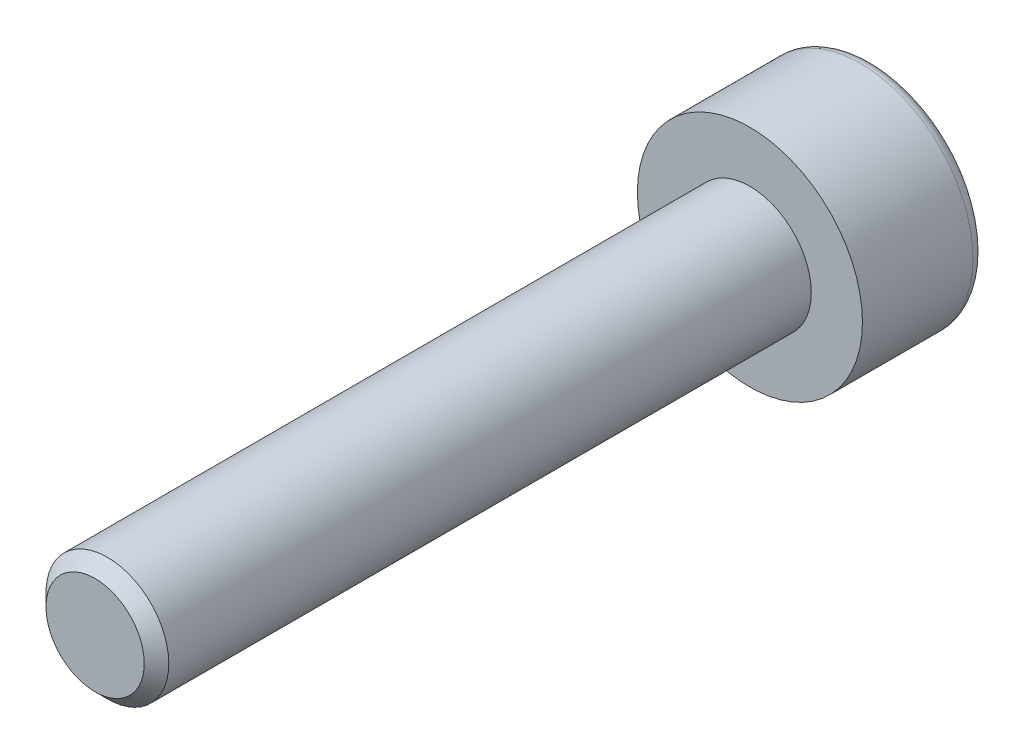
ISO-10303-21;
HEADER;
FILE_DESCRIPTION(('STEP AP214'),'2;1');
FILE_NAME('part.step','',(''),(''),'','','');
FILE_SCHEMA(('AUTOMOTIVE_DESIGN { 1 0 10303 214 1 1 1 1 }'));
ENDSEC;
DATA;
#1=APPLICATION_CONTEXT('core data for automotive mechanical design processes');
#2=APPLICATION_PROTOCOL_DEFINITION('international standard','automotive_design',2000,#1);
#3=PRODUCT_CONTEXT('',#1,'mechanical');
#4=PRODUCT('Part','Part','',(#3));
#5=PRODUCT_RELATED_PRODUCT_CATEGORY('part','',(#4));
#6=PRODUCT_DEFINITION_FORMATION('','',#4);
#7=PRODUCT_DEFINITION_CONTEXT('part definition',#1,'design');
#8=PRODUCT_DEFINITION('design','',#6,#7);
#9=PRODUCT_DEFINITION_SHAPE('','',#8);
#10=(LENGTH_UNIT() NAMED_UNIT(*) SI_UNIT(.MILLI.,.METRE.));
#11=(NAMED_UNIT(*) PLANE_ANGLE_UNIT() SI_UNIT($,.RADIAN.));
#12=(NAMED_UNIT(*) SI_UNIT($,.STERADIAN.) SOLID_ANGLE_UNIT());
#13=UNCERTAINTY_MEASURE_WITH_UNIT(LENGTH_MEASURE(1.E-05),#10,'distance_accuracy_value','');
#14=(GEOMETRIC_REPRESENTATION_CONTEXT(3) GLOBAL_UNCERTAINTY_ASSIGNED_CONTEXT((#13)) GLOBAL_UNIT_ASSIGNED_CONTEXT((#10,
#11,#12)) REPRESENTATION_CONTEXT('',''));
#15=CARTESIAN_POINT('',(0.,0.,0.));
#16=DIRECTION('',(0.,0.,1.));
#17=DIRECTION('',(1.,0.,0.));
#18=AXIS2_PLACEMENT_3D('',#15,#16,#17);
#19=CARTESIAN_POINT('',(0.,0.,-3.));
#20=DIRECTION('',(0.,0.,1.));
#21=DIRECTION('',(1.,0.,0.));
#22=AXIS2_PLACEMENT_3D('',#19,#20,#21);
#23=PLANE('',#22);
#24=CARTESIAN_POINT('',(0.,0.,-3.));
#25=DIRECTION('',(0.,0.,-1.));
#26=DIRECTION('',(-1.,0.,0.));
#27=AXIS2_PLACEMENT_3D('',#24,#25,#26);
#28=CIRCLE('',#27,2.45);
#29=CARTESIAN_POINT('',(-2.45,0.,-3.));
#30=VERTEX_POINT('',#29);
#31=EDGE_CURVE('E138',#30,#30,#28,.T.);
#32=ORIENTED_EDGE('',*,*,#31,.T.);
#33=EDGE_LOOP('',(#32));
#34=FACE_BOUND('',#33,.T.);
#35=DIRECTION('',(-0.86602540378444,0.499999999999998,0.));
#36=VECTOR('',#35,1.);
#37=CARTESIAN_POINT('',(0.,1.44337567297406,-3.));
#38=LINE('',#37,#36);
#39=CARTESIAN_POINT('',(1.25,0.721687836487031,-3.));
#40=VERTEX_POINT('',#39);
#41=CARTESIAN_POINT('',(0.,1.44337567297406,-3.));
#42=VERTEX_POINT('',#41);
#43=EDGE_CURVE('E42',#40,#42,#38,.T.);
#44=ORIENTED_EDGE('',*,*,#43,.T.);
#45=DIRECTION('',(-0.866025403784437,-0.500000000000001,0.));
#46=VECTOR('',#45,1.);
#47=CARTESIAN_POINT('',(0.,1.44337567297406,-3.));
#48=LINE('',#47,#46);
#49=CARTESIAN_POINT('',(-1.24999999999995,0.721687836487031,-3.));
#50=VERTEX_POINT('',#49);
#51=EDGE_CURVE('E82',#42,#50,#48,.T.);
#52=ORIENTED_EDGE('',*,*,#51,.T.);
#53=DIRECTION('',(0.,-1.,0.));
#54=VECTOR('',#53,1.);
#55=CARTESIAN_POINT('',(-1.24999999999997,-0.721687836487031,-3.));
#56=LINE('',#55,#54);
#57=CARTESIAN_POINT('',(-1.24999999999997,-0.721687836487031,-3.));
#58=VERTEX_POINT('',#57);
#59=EDGE_CURVE('E90',#50,#58,#56,.T.);
#60=ORIENTED_EDGE('',*,*,#59,.T.);
#61=DIRECTION('',(0.866025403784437,-0.500000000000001,0.));
#62=VECTOR('',#61,1.);
#63=CARTESIAN_POINT('',(0.,-1.44337567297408,-3.));
#64=LINE('',#63,#62);
#65=CARTESIAN_POINT('',(0.,-1.44337567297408,-3.));
#66=VERTEX_POINT('',#65);
#67=EDGE_CURVE('E108',#58,#66,#64,.T.);
#68=ORIENTED_EDGE('',*,*,#67,.T.);
#69=DIRECTION('',(0.866025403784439,0.499999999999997,0.));
#70=VECTOR('',#69,1.);
#71=CARTESIAN_POINT('',(0.,-1.44337567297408,-3.));
#72=LINE('',#71,#70);
#73=CARTESIAN_POINT('',(1.25,-0.721687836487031,-3.));
#74=VERTEX_POINT('',#73);
#75=EDGE_CURVE('E111',#66,#74,#72,.T.);
#76=ORIENTED_EDGE('',*,*,#75,.T.);
#77=DIRECTION('',(0.,1.,0.));
#78=VECTOR('',#77,1.);
#79=CARTESIAN_POINT('',(1.25,-0.721687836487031,-3.));
#80=LINE('',#79,#78);
#81=EDGE_CURVE('E101',#74,#40,#80,.T.);
#82=ORIENTED_EDGE('',*,*,#81,.T.);
#83=EDGE_LOOP('',(#44,#52,#60,#68,#76,#82));
#84=FACE_BOUND('',#83,.T.);
#85=ADVANCED_FACE('F28',(#34,#84),#23,.F.);
#86=CARTESIAN_POINT('',(0.,0.,-2.7));
#87=DIRECTION('',(0.,0.,-1.));
#88=DIRECTION('',(-1.,0.,0.));
#89=AXIS2_PLACEMENT_3D('',#86,#87,#88);
#90=TOROIDAL_SURFACE('',#89,2.45,0.299999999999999);
#91=ORIENTED_EDGE('',*,*,#31,.F.);
#92=EDGE_LOOP('',(#91));
#93=FACE_BOUND('',#92,.T.);
#94=CARTESIAN_POINT('',(0.,0.,-2.7));
#95=DIRECTION('',(0.,0.,-1.));
#96=DIRECTION('',(-1.,0.,0.));
#97=AXIS2_PLACEMENT_3D('',#94,#95,#96);
#98=CIRCLE('',#97,2.75);
#99=CARTESIAN_POINT('',(-2.75,0.,-2.7));
#100=VERTEX_POINT('',#99);
#101=EDGE_CURVE('E135',#100,#100,#98,.T.);
#102=ORIENTED_EDGE('',*,*,#101,.T.);
#103=EDGE_LOOP('',(#102));
#104=FACE_BOUND('',#103,.T.);
#105=ADVANCED_FACE('F157',(#93,#104),#90,.T.);
#106=CARTESIAN_POINT('',(0.,0.,0.));
#107=DIRECTION('',(0.,0.,-1.));
#108=DIRECTION('',(-1.,0.,0.));
#109=AXIS2_PLACEMENT_3D('',#106,#107,#108);
#110=CYLINDRICAL_SURFACE('',#109,2.75);
#111=CARTESIAN_POINT('',(0.,0.,0.));
#112=DIRECTION('',(0.,0.,-1.));
#113=DIRECTION('',(-1.,0.,0.));
#114=AXIS2_PLACEMENT_3D('',#111,#112,#113);
#115=CIRCLE('',#114,2.75);
#116=CARTESIAN_POINT('',(-2.75,0.,0.));
#117=VERTEX_POINT('',#116);
#118=EDGE_CURVE('E96',#117,#117,#115,.T.);
#119=CARTESIAN_POINT('',(-2.75,0.,-2.7));
#120=CARTESIAN_POINT('',(-2.75,0.,-2.671875));
#121=CARTESIAN_POINT('',(-2.75,0.,-2.64375));
#122=CARTESIAN_POINT('',(-2.75,0.,-2.5875));
#123=CARTESIAN_POINT('',(-2.75,0.,-2.559375));
#124=CARTESIAN_POINT('',(-2.75,0.,-2.503125));
#125=CARTESIAN_POINT('',(-2.75,0.,-2.475));
#126=CARTESIAN_POINT('',(-2.75,0.,-2.41875));
#127=CARTESIAN_POINT('',(-2.75,0.,-2.390625));
#128=CARTESIAN_POINT('',(-2.75,0.,-2.334375));
#129=CARTESIAN_POINT('',(-2.75,0.,-2.30625));
#130=CARTESIAN_POINT('',(-2.75,0.,-2.25));
#131=CARTESIAN_POINT('',(-2.75,0.,-2.221875));
#132=CARTESIAN_POINT('',(-2.75,0.,-2.165625));
#133=CARTESIAN_POINT('',(-2.75,0.,-2.1375));
#134=CARTESIAN_POINT('',(-2.75,0.,-2.08125));
#135=CARTESIAN_POINT('',(-2.75,0.,-2.053125));
#136=CARTESIAN_POINT('',(-2.75,0.,-1.996875));
#137=CARTESIAN_POINT('',(-2.75,0.,-1.96875));
#138=CARTESIAN_POINT('',(-2.75,0.,-1.9125));
#139=CARTESIAN_POINT('',(-2.75,0.,-1.884375));
#140=CARTESIAN_POINT('',(-2.75,0.,-1.828125));
#141=CARTESIAN_POINT('',(-2.75,0.,-1.8));
#142=CARTESIAN_POINT('',(-2.75,0.,-1.74375));
#143=CARTESIAN_POINT('',(-2.75,0.,-1.715625));
#144=CARTESIAN_POINT('',(-2.75,0.,-1.659375));
#145=CARTESIAN_POINT('',(-2.75,0.,-1.63125));
#146=CARTESIAN_POINT('',(-2.75,0.,-1.575));
#147=CARTESIAN_POINT('',(-2.75,0.,-1.546875));
#148=CARTESIAN_POINT('',(-2.75,0.,-1.490625));
#149=CARTESIAN_POINT('',(-2.75,0.,-1.4625));
#150=CARTESIAN_POINT('',(-2.75,0.,-1.40625));
#151=CARTESIAN_POINT('',(-2.75,0.,-1.378125));
#152=CARTESIAN_POINT('',(-2.75,0.,-1.321875));
#153=CARTESIAN_POINT('',(-2.75,0.,-1.29375));
#154=CARTESIAN_POINT('',(-2.75,0.,-1.2375));
#155=CARTESIAN_POINT('',(-2.75,0.,-1.209375));
#156=CARTESIAN_POINT('',(-2.75,0.,-1.153125));
#157=CARTESIAN_POINT('',(-2.75,0.,-1.125));
#158=CARTESIAN_POINT('',(-2.75,0.,-1.06875));
#159=CARTESIAN_POINT('',(-2.75,0.,-1.040625));
#160=CARTESIAN_POINT('',(-2.75,0.,-0.984374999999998));
#161=CARTESIAN_POINT('',(-2.75,0.,-0.956249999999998));
#162=CARTESIAN_POINT('',(-2.75,0.,-0.899999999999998));
#163=CARTESIAN_POINT('',(-2.75,0.,-0.871874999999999));
#164=CARTESIAN_POINT('',(-2.75,0.,-0.815624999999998));
#165=CARTESIAN_POINT('',(-2.75,0.,-0.787499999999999));
#166=CARTESIAN_POINT('',(-2.75,0.,-0.731249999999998));
#167=CARTESIAN_POINT('',(-2.75,0.,-0.703124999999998));
#168=CARTESIAN_POINT('',(-2.75,0.,-0.646874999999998));
#169=CARTESIAN_POINT('',(-2.75,0.,-0.618749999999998));
#170=CARTESIAN_POINT('',(-2.75,0.,-0.562499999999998));
#171=CARTESIAN_POINT('',(-2.75,0.,-0.534374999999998));
#172=CARTESIAN_POINT('',(-2.75,0.,-0.478124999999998));
#173=CARTESIAN_POINT('',(-2.75,0.,-0.449999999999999));
#174=CARTESIAN_POINT('',(-2.75,0.,-0.393749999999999));
#175=CARTESIAN_POINT('',(-2.75,0.,-0.365624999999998));
#176=CARTESIAN_POINT('',(-2.75,0.,-0.309374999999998));
#177=CARTESIAN_POINT('',(-2.75,0.,-0.281249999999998));
#178=CARTESIAN_POINT('',(-2.75,0.,-0.224999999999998));
#179=CARTESIAN_POINT('',(-2.75,0.,-0.196874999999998));
#180=CARTESIAN_POINT('',(-2.75,0.,-0.140624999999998));
#181=CARTESIAN_POINT('',(-2.75,0.,-0.112499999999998));
#182=CARTESIAN_POINT('',(-2.75,0.,-0.0562499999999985));
#183=CARTESIAN_POINT('',(-2.75,0.,-0.0281249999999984));
#184=CARTESIAN_POINT('',(-2.75,0.,0.));
#185=B_SPLINE_CURVE_WITH_KNOTS('',3,(#119,#120,#121,#122,#123,#124,#125,#126,#127,#128,#129,
#130,#131,#132,#133,#134,#135,#136,#137,#138,#139,#140,#141,#142,#143,#144,#145,#146,#147,#148,
#149,#150,#151,#152,#153,#154,#155,#156,#157,#158,#159,#160,#161,#162,#163,#164,#165,#166,#167,
#168,#169,#170,#171,#172,#173,#174,#175,#176,#177,#178,#179,#180,#181,#182,#183,#184),
.UNSPECIFIED.,.F.,.F.,(4,2,2,2,2,2,2,2,2,2,2,2,2,2,2,2,2,2,2,2,2,2,2,2,2,2,2,2,2,2,2,2,4),(0.,
0.0843750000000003,0.16875,0.253125,0.3375,0.421875,0.50625,0.590625,0.675,0.759375,0.84375,
0.928125,1.0125,1.096875,1.18125,1.265625,1.35,1.434375,1.51875,1.603125,1.6875,1.771875,
1.85625,1.940625,2.025,2.109375,2.19375,2.278125,2.3625,2.446875,2.53125,2.615625,2.7),.UNSPECIFIED.);
#186=EDGE_CURVE('BSEAM162',#100,#117,#185,.T.);
#187=ORIENTED_EDGE('',*,*,#101,.F.);
#188=ORIENTED_EDGE('',*,*,#118,.T.);
#189=ORIENTED_EDGE('',*,*,#186,.T.);
#190=ORIENTED_EDGE('',*,*,#186,.F.);
#191=EDGE_LOOP('',(#187,#189,#188,#190));
#192=FACE_BOUND('',#191,.T.);
#193=ADVANCED_FACE('F162',(#192),#110,.T.);
#194=CARTESIAN_POINT('',(0.,0.,0.));
#195=DIRECTION('',(0.,0.,-1.));
#196=DIRECTION('',(-1.,0.,0.));
#197=AXIS2_PLACEMENT_3D('',#194,#195,#196);
#198=PLANE('',#197);
#199=CARTESIAN_POINT('',(0.,0.,0.));
#200=DIRECTION('',(0.,0.,1.));
#201=DIRECTION('',(1.,0.,0.));
#202=AXIS2_PLACEMENT_3D('',#199,#200,#201);
#203=CIRCLE('',#202,1.5);
#204=CARTESIAN_POINT('',(1.5,0.,0.));
#205=VERTEX_POINT('',#204);
#206=EDGE_CURVE('E102',#205,#205,#203,.T.);
#207=ORIENTED_EDGE('',*,*,#206,.F.);
#208=EDGE_LOOP('',(#207));
#209=FACE_BOUND('',#208,.T.);
#210=ORIENTED_EDGE('',*,*,#118,.F.);
#211=EDGE_LOOP('',(#210));
#212=FACE_BOUND('',#211,.T.);
#213=ADVANCED_FACE('F170',(#209,#212),#198,.F.);
#214=CARTESIAN_POINT('',(0.,1.44337567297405,-1.69999999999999));
#215=DIRECTION('',(-0.499999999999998,-0.86602540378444,0.));
#216=DIRECTION('',(0.86602540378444,-0.499999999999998,0.));
#217=AXIS2_PLACEMENT_3D('',#214,#215,#216);
#218=PLANE('',#217);
#219=ORIENTED_EDGE('',*,*,#43,.F.);
#220=DIRECTION('',(0.,0.,-1.));
#221=VECTOR('',#220,1.);
#222=CARTESIAN_POINT('',(1.25000000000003,0.721687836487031,-1.7));
#223=LINE('',#222,#221);
#224=CARTESIAN_POINT('',(1.25000000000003,0.721687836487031,-1.7));
#225=VERTEX_POINT('',#224);
#226=EDGE_CURVE('E124',#225,#40,#223,.T.);
#227=ORIENTED_EDGE('',*,*,#226,.F.);
#228=DIRECTION('',(-0.86602540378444,0.499999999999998,0.));
#229=VECTOR('',#228,1.);
#230=CARTESIAN_POINT('',(0.,1.44337567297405,-1.69999999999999));
#231=LINE('',#230,#229);
#232=CARTESIAN_POINT('',(0.,1.44337567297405,-1.69999999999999));
#233=VERTEX_POINT('',#232);
#234=EDGE_CURVE('E95',#225,#233,#231,.T.);
#235=ORIENTED_EDGE('',*,*,#234,.T.);
#236=DIRECTION('',(0.,0.,-1.));
#237=VECTOR('',#236,1.);
#238=CARTESIAN_POINT('',(0.,1.44337567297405,-1.69999999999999));
#239=LINE('',#238,#237);
#240=EDGE_CURVE('E84',#233,#42,#239,.T.);
#241=ORIENTED_EDGE('',*,*,#240,.T.);
#242=EDGE_LOOP('',(#219,#227,#235,#241));
#243=FACE_BOUND('',#242,.T.);
#244=ADVANCED_FACE('F93',(#243),#218,.T.);
#245=CARTESIAN_POINT('',(0.,1.44337567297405,-1.69999999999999));
#246=DIRECTION('',(0.500000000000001,-0.866025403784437,0.));
#247=DIRECTION('',(0.866025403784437,0.500000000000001,0.));
#248=AXIS2_PLACEMENT_3D('',#245,#246,#247);
#249=PLANE('',#248);
#250=ORIENTED_EDGE('',*,*,#51,.F.);
#251=ORIENTED_EDGE('',*,*,#240,.F.);
#252=DIRECTION('',(-0.866025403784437,-0.500000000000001,0.));
#253=VECTOR('',#252,1.);
#254=CARTESIAN_POINT('',(0.,1.44337567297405,-1.69999999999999));
#255=LINE('',#254,#253);
#256=CARTESIAN_POINT('',(-1.25,0.721687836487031,-1.7));
#257=VERTEX_POINT('',#256);
#258=EDGE_CURVE('E115',#233,#257,#255,.T.);
#259=ORIENTED_EDGE('',*,*,#258,.T.);
#260=DIRECTION('',(0.,0.,-1.));
#261=VECTOR('',#260,1.);
#262=CARTESIAN_POINT('',(-1.25,0.721687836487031,-1.7));
#263=LINE('',#262,#261);
#264=EDGE_CURVE('E86',#257,#50,#263,.T.);
#265=ORIENTED_EDGE('',*,*,#264,.T.);
#266=EDGE_LOOP('',(#250,#251,#259,#265));
#267=FACE_BOUND('',#266,.T.);
#268=ADVANCED_FACE('F83',(#267),#249,.T.);
#269=CARTESIAN_POINT('',(-1.24999999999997,-0.721687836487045,-1.69999999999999));
#270=DIRECTION('',(1.,0.,0.));
#271=DIRECTION('',(0.,0.,-1.));
#272=AXIS2_PLACEMENT_3D('',#269,#270,#271);
#273=PLANE('',#272);
#274=ORIENTED_EDGE('',*,*,#59,.F.);
#275=ORIENTED_EDGE('',*,*,#264,.F.);
#276=DIRECTION('',(0.,-1.,0.));
#277=VECTOR('',#276,1.);
#278=CARTESIAN_POINT('',(-1.24999999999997,-0.721687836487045,-1.69999999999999));
#279=LINE('',#278,#277);
#280=CARTESIAN_POINT('',(-1.24999999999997,-0.721687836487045,-1.69999999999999));
#281=VERTEX_POINT('',#280);
#282=EDGE_CURVE('E117',#257,#281,#279,.T.);
#283=ORIENTED_EDGE('',*,*,#282,.T.);
#284=DIRECTION('',(0.,0.,-1.));
#285=VECTOR('',#284,1.);
#286=CARTESIAN_POINT('',(-1.24999999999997,-0.721687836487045,-1.69999999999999));
#287=LINE('',#286,#285);
#288=EDGE_CURVE('E130',#281,#58,#287,.T.);
#289=ORIENTED_EDGE('',*,*,#288,.T.);
#290=EDGE_LOOP('',(#274,#275,#283,#289));
#291=FACE_BOUND('',#290,.T.);
#292=ADVANCED_FACE('F185',(#291),#273,.T.);
#293=CARTESIAN_POINT('',(0.,-1.44337567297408,-1.7));
#294=DIRECTION('',(0.500000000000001,0.866025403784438,0.));
#295=DIRECTION('',(-0.866025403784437,0.500000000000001,0.));
#296=AXIS2_PLACEMENT_3D('',#293,#294,#295);
#297=PLANE('',#296);
#298=ORIENTED_EDGE('',*,*,#67,.F.);
#299=ORIENTED_EDGE('',*,*,#288,.F.);
#300=DIRECTION('',(0.866025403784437,-0.500000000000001,0.));
#301=VECTOR('',#300,1.);
#302=CARTESIAN_POINT('',(0.,-1.44337567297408,-1.7));
#303=LINE('',#302,#301);
#304=CARTESIAN_POINT('',(0.,-1.44337567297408,-1.7));
#305=VERTEX_POINT('',#304);
#306=EDGE_CURVE('E119',#281,#305,#303,.T.);
#307=ORIENTED_EDGE('',*,*,#306,.T.);
#308=DIRECTION('',(0.,0.,-1.));
#309=VECTOR('',#308,1.);
#310=CARTESIAN_POINT('',(0.,-1.44337567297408,-1.7));
#311=LINE('',#310,#309);
#312=EDGE_CURVE('E128',#305,#66,#311,.T.);
#313=ORIENTED_EDGE('',*,*,#312,.T.);
#314=EDGE_LOOP('',(#298,#299,#307,#313));
#315=FACE_BOUND('',#314,.T.);
#316=ADVANCED_FACE('F188',(#315),#297,.T.);
#317=CARTESIAN_POINT('',(0.,-1.44337567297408,-1.7));
#318=DIRECTION('',(-0.499999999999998,0.86602540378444,0.));
#319=DIRECTION('',(-0.86602540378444,-0.499999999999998,0.));
#320=AXIS2_PLACEMENT_3D('',#317,#318,#319);
#321=PLANE('',#320);
#322=ORIENTED_EDGE('',*,*,#75,.F.);
#323=ORIENTED_EDGE('',*,*,#312,.F.);
#324=DIRECTION('',(0.866025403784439,0.499999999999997,0.));
#325=VECTOR('',#324,1.);
#326=CARTESIAN_POINT('',(0.,-1.44337567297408,-1.7));
#327=LINE('',#326,#325);
#328=CARTESIAN_POINT('',(1.25,-0.721687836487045,-1.69999999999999));
#329=VERTEX_POINT('',#328);
#330=EDGE_CURVE('E121',#305,#329,#327,.T.);
#331=ORIENTED_EDGE('',*,*,#330,.T.);
#332=DIRECTION('',(0.,0.,-1.));
#333=VECTOR('',#332,1.);
#334=CARTESIAN_POINT('',(1.25,-0.721687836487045,-1.69999999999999));
#335=LINE('',#334,#333);
#336=EDGE_CURVE('E126',#329,#74,#335,.T.);
#337=ORIENTED_EDGE('',*,*,#336,.T.);
#338=EDGE_LOOP('',(#322,#323,#331,#337));
#339=FACE_BOUND('',#338,.T.);
#340=ADVANCED_FACE('F192',(#339),#321,.T.);
#341=CARTESIAN_POINT('',(1.25,-0.721687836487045,-1.69999999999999));
#342=DIRECTION('',(-1.,0.,0.));
#343=DIRECTION('',(0.,0.,1.));
#344=AXIS2_PLACEMENT_3D('',#341,#342,#343);
#345=PLANE('',#344);
#346=ORIENTED_EDGE('',*,*,#81,.F.);
#347=ORIENTED_EDGE('',*,*,#336,.F.);
#348=DIRECTION('',(0.,1.,0.));
#349=VECTOR('',#348,1.);
#350=CARTESIAN_POINT('',(1.25,-0.721687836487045,-1.69999999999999));
#351=LINE('',#350,#349);
#352=EDGE_CURVE('E49',#329,#225,#351,.T.);
#353=ORIENTED_EDGE('',*,*,#352,.T.);
#354=ORIENTED_EDGE('',*,*,#226,.T.);
#355=EDGE_LOOP('',(#346,#347,#353,#354));
#356=FACE_BOUND('',#355,.T.);
#357=ADVANCED_FACE('F196',(#356),#345,.T.);
#358=CARTESIAN_POINT('',(1.25000000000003,0.721687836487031,-1.7));
#359=DIRECTION('',(0.,0.,1.));
#360=DIRECTION('',(1.,0.,0.));
#361=AXIS2_PLACEMENT_3D('',#358,#359,#360);
#362=PLANE('',#361);
#363=ORIENTED_EDGE('',*,*,#234,.F.);
#364=ORIENTED_EDGE('',*,*,#352,.F.);
#365=ORIENTED_EDGE('',*,*,#330,.F.);
#366=ORIENTED_EDGE('',*,*,#306,.F.);
#367=ORIENTED_EDGE('',*,*,#282,.F.);
#368=ORIENTED_EDGE('',*,*,#258,.F.);
#369=EDGE_LOOP('',(#363,#364,#365,#366,#367,#368));
#370=FACE_BOUND('',#369,.T.);
#371=ADVANCED_FACE('F200',(#370),#362,.F.);
#372=CARTESIAN_POINT('',(0.,0.,16.));
#373=DIRECTION('',(0.,0.,1.));
#374=DIRECTION('',(1.,0.,0.));
#375=AXIS2_PLACEMENT_3D('',#372,#373,#374);
#376=PLANE('',#375);
#377=CARTESIAN_POINT('',(0.,0.,16.));
#378=DIRECTION('',(0.,0.,1.));
#379=DIRECTION('',(1.,0.,0.));
#380=AXIS2_PLACEMENT_3D('',#377,#378,#379);
#381=CIRCLE('',#380,1.2);
#382=CARTESIAN_POINT('',(1.2,0.,16.));
#383=VERTEX_POINT('',#382);
#384=EDGE_CURVE('E35',#383,#383,#381,.T.);
#385=ORIENTED_EDGE('',*,*,#384,.T.);
#386=EDGE_LOOP('',(#385));
#387=FACE_BOUND('',#386,.T.);
#388=ADVANCED_FACE('F143',(#387),#376,.T.);
#389=CARTESIAN_POINT('',(0.,0.,0.));
#390=DIRECTION('',(0.,0.,1.));
#391=DIRECTION('',(1.,0.,0.));
#392=AXIS2_PLACEMENT_3D('',#389,#390,#391);
#393=CYLINDRICAL_SURFACE('',#392,1.5);
#394=CARTESIAN_POINT('',(0.,0.,15.7));
#395=DIRECTION('',(0.,0.,1.));
#396=DIRECTION('',(1.,0.,0.));
#397=AXIS2_PLACEMENT_3D('',#394,#395,#396);
#398=CIRCLE('',#397,1.5);
#399=CARTESIAN_POINT('',(1.5,0.,15.7));
#400=VERTEX_POINT('',#399);
#401=EDGE_CURVE('E11',#400,#400,#398,.F.);
#402=CARTESIAN_POINT('',(1.5,0.,15.7));
#403=CARTESIAN_POINT('',(1.5,0.,15.5364583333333));
#404=CARTESIAN_POINT('',(1.5,0.,15.3729166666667));
#405=CARTESIAN_POINT('',(1.5,0.,15.0458333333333));
#406=CARTESIAN_POINT('',(1.5,0.,14.8822916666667));
#407=CARTESIAN_POINT('',(1.5,0.,14.5552083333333));
#408=CARTESIAN_POINT('',(1.5,0.,14.3916666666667));
#409=CARTESIAN_POINT('',(1.5,0.,14.0645833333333));
#410=CARTESIAN_POINT('',(1.5,0.,13.9010416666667));
#411=CARTESIAN_POINT('',(1.5,0.,13.5739583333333));
#412=CARTESIAN_POINT('',(1.5,0.,13.4104166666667));
#413=CARTESIAN_POINT('',(1.5,0.,13.0833333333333));
#414=CARTESIAN_POINT('',(1.5,0.,12.9197916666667));
#415=CARTESIAN_POINT('',(1.5,0.,12.5927083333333));
#416=CARTESIAN_POINT('',(1.5,0.,12.4291666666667));
#417=CARTESIAN_POINT('',(1.5,0.,12.1020833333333));
#418=CARTESIAN_POINT('',(1.5,0.,11.9385416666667));
#419=CARTESIAN_POINT('',(1.5,0.,11.6114583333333));
#420=CARTESIAN_POINT('',(1.5,0.,11.4479166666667));
#421=CARTESIAN_POINT('',(1.5,0.,11.1208333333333));
#422=CARTESIAN_POINT('',(1.5,0.,10.9572916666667));
#423=CARTESIAN_POINT('',(1.5,0.,10.6302083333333));
#424=CARTESIAN_POINT('',(1.5,0.,10.4666666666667));
#425=CARTESIAN_POINT('',(1.5,0.,10.1395833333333));
#426=CARTESIAN_POINT('',(1.5,0.,9.97604166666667));
#427=CARTESIAN_POINT('',(1.5,0.,9.64895833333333));
#428=CARTESIAN_POINT('',(1.5,0.,9.48541666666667));
#429=CARTESIAN_POINT('',(1.5,0.,9.15833333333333));
#430=CARTESIAN_POINT('',(1.5,0.,8.99479166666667));
#431=CARTESIAN_POINT('',(1.5,0.,8.66770833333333));
#432=CARTESIAN_POINT('',(1.5,0.,8.50416666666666));
#433=CARTESIAN_POINT('',(1.5,0.,8.17708333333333));
#434=CARTESIAN_POINT('',(1.5,0.,8.01354166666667));
#435=CARTESIAN_POINT('',(1.5,0.,7.68645833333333));
#436=CARTESIAN_POINT('',(1.5,0.,7.52291666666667));
#437=CARTESIAN_POINT('',(1.5,0.,7.19583333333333));
#438=CARTESIAN_POINT('',(1.5,0.,7.03229166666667));
#439=CARTESIAN_POINT('',(1.5,0.,6.70520833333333));
#440=CARTESIAN_POINT('',(1.5,0.,6.54166666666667));
#441=CARTESIAN_POINT('',(1.5,0.,6.21458333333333));
#442=CARTESIAN_POINT('',(1.5,0.,6.05104166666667));
#443=CARTESIAN_POINT('',(1.5,0.,5.72395833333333));
#444=CARTESIAN_POINT('',(1.5,0.,5.56041666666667));
#445=CARTESIAN_POINT('',(1.5,0.,5.23333333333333));
#446=CARTESIAN_POINT('',(1.5,0.,5.06979166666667));
#447=CARTESIAN_POINT('',(1.5,0.,4.74270833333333));
#448=CARTESIAN_POINT('',(1.5,0.,4.57916666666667));
#449=CARTESIAN_POINT('',(1.5,0.,4.25208333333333));
#450=CARTESIAN_POINT('',(1.5,0.,4.08854166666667));
#451=CARTESIAN_POINT('',(1.5,0.,3.76145833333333));
#452=CARTESIAN_POINT('',(1.5,0.,3.59791666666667));
#453=CARTESIAN_POINT('',(1.5,0.,3.27083333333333));
#454=CARTESIAN_POINT('',(1.5,0.,3.10729166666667));
#455=CARTESIAN_POINT('',(1.5,0.,2.78020833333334));
#456=CARTESIAN_POINT('',(1.5,0.,2.61666666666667));
#457=CARTESIAN_POINT('',(1.5,0.,2.28958333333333));
#458=CARTESIAN_POINT('',(1.5,0.,2.12604166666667));
#459=CARTESIAN_POINT('',(1.5,0.,1.79895833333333));
#460=CARTESIAN_POINT('',(1.5,0.,1.63541666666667));
#461=CARTESIAN_POINT('',(1.5,0.,1.30833333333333));
#462=CARTESIAN_POINT('',(1.5,0.,1.14479166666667));
#463=CARTESIAN_POINT('',(1.5,0.,0.817708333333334));
#464=CARTESIAN_POINT('',(1.5,0.,0.654166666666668));
#465=CARTESIAN_POINT('',(1.5,0.,0.327083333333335));
#466=CARTESIAN_POINT('',(1.5,0.,0.163541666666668));
#467=CARTESIAN_POINT('',(1.5,0.,0.));
#468=B_SPLINE_CURVE_WITH_KNOTS('',3,(#402,#403,#404,#405,#406,#407,#408,#409,#410,#411,#412,
#413,#414,#415,#416,#417,#418,#419,#420,#421,#422,#423,#424,#425,#426,#427,#428,#429,#430,#431,
#432,#433,#434,#435,#436,#437,#438,#439,#440,#441,#442,#443,#444,#445,#446,#447,#448,#449,#450,
#451,#452,#453,#454,#455,#456,#457,#458,#459,#460,#461,#462,#463,#464,#465,#466,#467),
.UNSPECIFIED.,.F.,.F.,(4,2,2,2,2,2,2,2,2,2,2,2,2,2,2,2,2,2,2,2,2,2,2,2,2,2,2,2,2,2,2,2,4),(0.,
0.490624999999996,0.981249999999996,1.471875,1.9625,2.453125,2.94375,3.434375,3.925,4.415625,
4.90625,5.396875,5.8875,6.37812499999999,6.86875,7.359375,7.85,8.34062499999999,
8.83124999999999,9.32187499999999,9.81249999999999,10.303125,10.79375,11.284375,11.775,
12.265625,12.75625,13.246875,13.7375,14.228125,14.71875,15.209375,15.7),.UNSPECIFIED.);
#469=EDGE_CURVE('BSEAM147',#400,#205,#468,.T.);
#470=ORIENTED_EDGE('',*,*,#401,.T.);
#471=ORIENTED_EDGE('',*,*,#206,.T.);
#472=ORIENTED_EDGE('',*,*,#469,.T.);
#473=ORIENTED_EDGE('',*,*,#469,.F.);
#474=EDGE_LOOP('',(#470,#472,#471,#473));
#475=FACE_BOUND('',#474,.T.);
#476=ADVANCED_FACE('F147',(#475),#393,.T.);
#477=CARTESIAN_POINT('',(0.,0.,16.));
#478=DIRECTION('',(0.,0.,-1.));
#479=DIRECTION('',(-1.,0.,0.));
#480=AXIS2_PLACEMENT_3D('',#477,#478,#479);
#481=CONICAL_SURFACE('',#480,1.2,0.785398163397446);
#482=ORIENTED_EDGE('',*,*,#401,.F.);
#483=EDGE_LOOP('',(#482));
#484=FACE_BOUND('',#483,.T.);
#485=ORIENTED_EDGE('',*,*,#384,.F.);
#486=EDGE_LOOP('',(#485));
#487=FACE_BOUND('',#486,.T.);
#488=ADVANCED_FACE('F145',(#484,#487),#481,.T.);
#489=CLOSED_SHELL('',(#85,#105,#193,#213,#244,#268,#292,#316,#340,#357,#371,#388,#476,#488));
#490=MANIFOLD_SOLID_BREP('B2',#489);
#491=ADVANCED_BREP_SHAPE_REPRESENTATION('',(#18,#490),#14);
#492=SHAPE_DEFINITION_REPRESENTATION(#9,#491);
ENDSEC;
END-ISO-10303-21;
